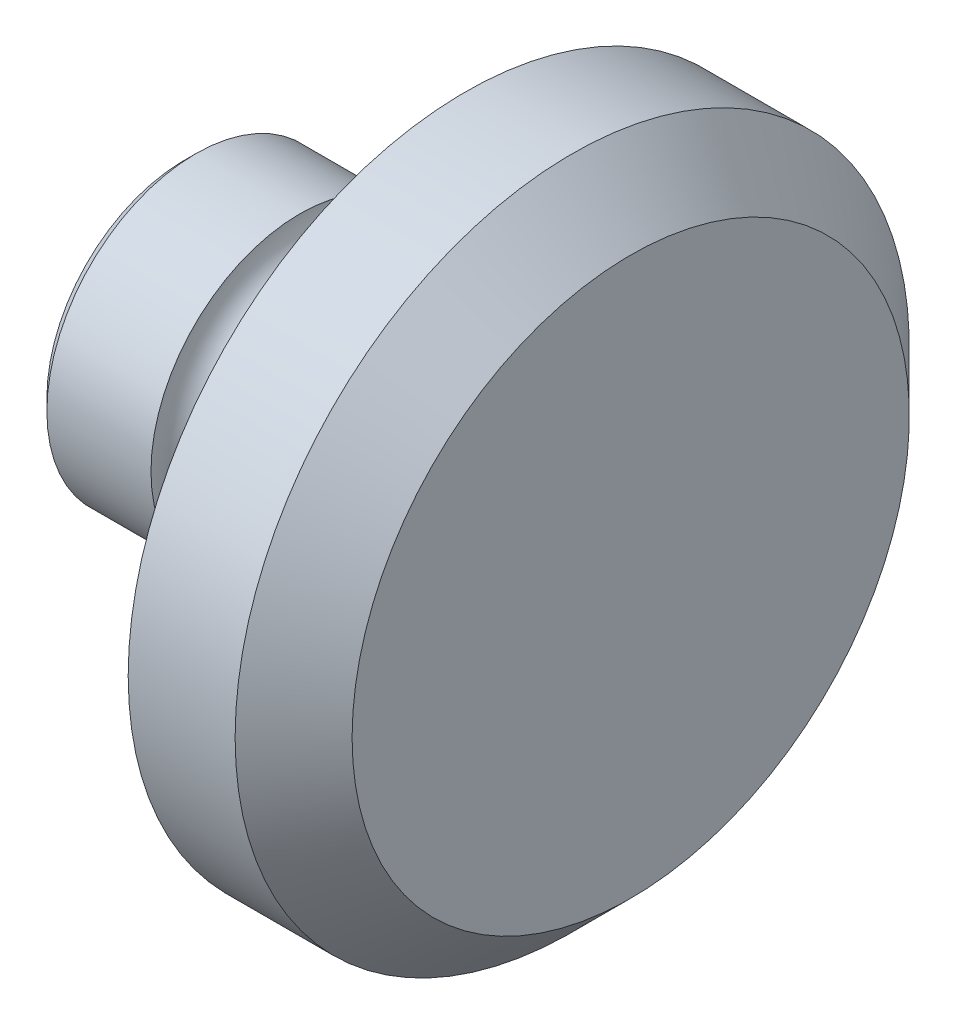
from build123d import *


with BuildPart() as part:
    # Sketch1 → Revolve1 (revolve)
    with BuildSketch(Plane.XY, mode=Mode.PRIVATE) as revolve1_sk:
        with BuildLine():
            Line((-21.757414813, 9), (-22.464521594, 8.292893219))
            Line((-22.464521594, 8.292893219), (-22.464521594, 0))
            Line((-22.464521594, 0), (4.535478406, 0))
            Line((4.535478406, 0), (4.535478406, 16.842937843))
            Line((4.535478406, 16.842937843), (0.9999445, 20.378471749))
            Line((0.9999445, 20.378471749), (-5.464521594, 20.378471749))
            Line((-5.464521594, 20.378471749), (-5.464521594, 9))
            Line((-5.464521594, 9), (-11.464521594, 9))
            ThreePointArc((-11.464521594, 9), (-13.464521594, 7), (-15.464521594, 9))
            Line((-15.464521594, 9), (-21.757414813, 9))
        make_face()
    revolve(revolve1_sk.sketch.rotate(Axis((-26.421046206, 0, 0), (1, 0, 0)), 90), axis=Axis((-26.421046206, 0, 0), (1, 0, 0)))


solid = part.part
